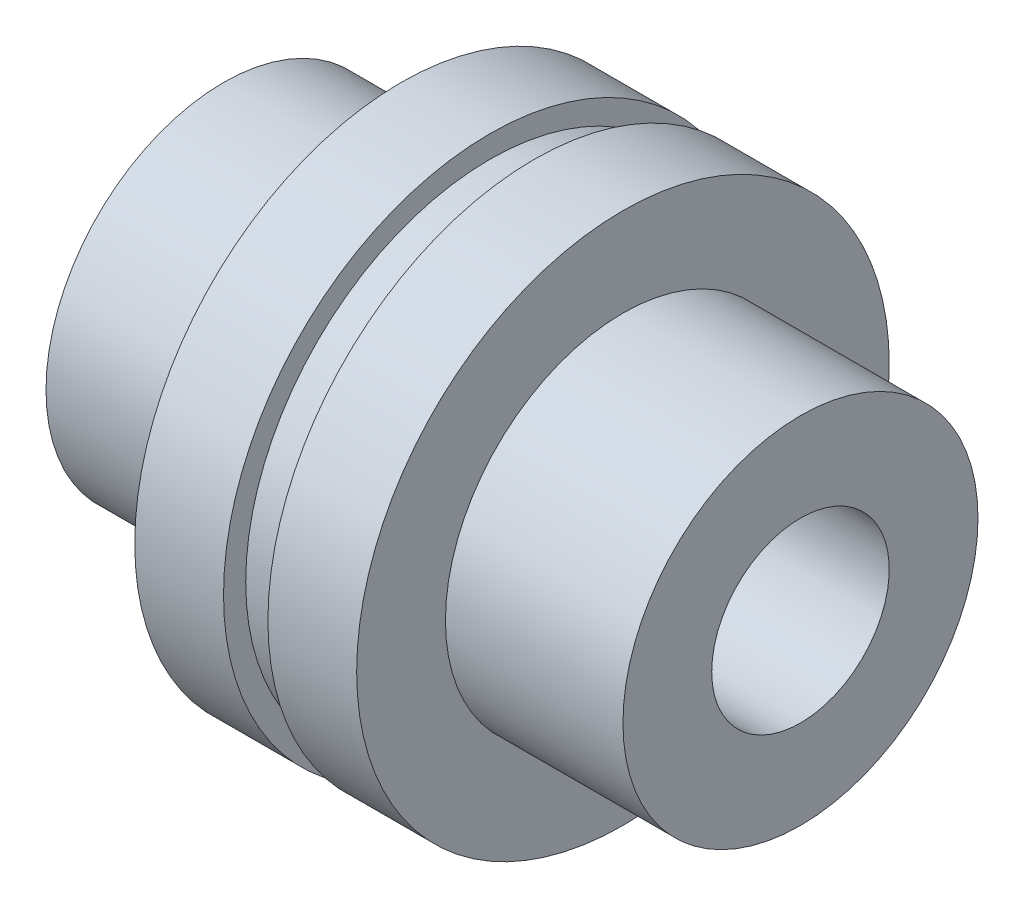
ISO-10303-21;
HEADER;
FILE_DESCRIPTION(('STEP AP214'),'2;1');
FILE_NAME('part.step','',(''),(''),'','','');
FILE_SCHEMA(('AUTOMOTIVE_DESIGN { 1 0 10303 214 1 1 1 1 }'));
ENDSEC;
DATA;
#1=APPLICATION_CONTEXT('core data for automotive mechanical design processes');
#2=APPLICATION_PROTOCOL_DEFINITION('international standard','automotive_design',2000,#1);
#3=PRODUCT_CONTEXT('',#1,'mechanical');
#4=PRODUCT('Part','Part','',(#3));
#5=PRODUCT_RELATED_PRODUCT_CATEGORY('part','',(#4));
#6=PRODUCT_DEFINITION_FORMATION('','',#4);
#7=PRODUCT_DEFINITION_CONTEXT('part definition',#1,'design');
#8=PRODUCT_DEFINITION('design','',#6,#7);
#9=PRODUCT_DEFINITION_SHAPE('','',#8);
#10=(LENGTH_UNIT() NAMED_UNIT(*) SI_UNIT(.MILLI.,.METRE.));
#11=(NAMED_UNIT(*) PLANE_ANGLE_UNIT() SI_UNIT($,.RADIAN.));
#12=(NAMED_UNIT(*) SI_UNIT($,.STERADIAN.) SOLID_ANGLE_UNIT());
#13=UNCERTAINTY_MEASURE_WITH_UNIT(LENGTH_MEASURE(1.E-05),#10,'distance_accuracy_value','');
#14=(GEOMETRIC_REPRESENTATION_CONTEXT(3) GLOBAL_UNCERTAINTY_ASSIGNED_CONTEXT((#13)) GLOBAL_UNIT_ASSIGNED_CONTEXT((#10,
#11,#12)) REPRESENTATION_CONTEXT('',''));
#15=CARTESIAN_POINT('',(0.,0.,0.));
#16=DIRECTION('',(0.,0.,1.));
#17=DIRECTION('',(1.,0.,0.));
#18=AXIS2_PLACEMENT_3D('',#15,#16,#17);
#19=CARTESIAN_POINT('',(0.,0.,0.));
#20=DIRECTION('',(-1.,0.,0.));
#21=DIRECTION('',(0.,0.,1.));
#22=AXIS2_PLACEMENT_3D('',#19,#20,#21);
#23=CYLINDRICAL_SURFACE('',#22,25.4);
#24=CARTESIAN_POINT('',(25.4,0.,0.));
#25=DIRECTION('',(-1.,0.,0.));
#26=DIRECTION('',(0.,0.,1.));
#27=AXIS2_PLACEMENT_3D('',#24,#25,#26);
#28=CIRCLE('',#27,25.4);
#29=CARTESIAN_POINT('',(25.4,0.,25.4));
#30=VERTEX_POINT('',#29);
#31=EDGE_CURVE('E68',#30,#30,#28,.T.);
#32=ORIENTED_EDGE('',*,*,#31,.T.);
#33=EDGE_LOOP('',(#32));
#34=FACE_BOUND('',#33,.T.);
#35=CARTESIAN_POINT('',(0.,0.,0.));
#36=DIRECTION('',(-1.,0.,0.));
#37=DIRECTION('',(0.,0.,1.));
#38=AXIS2_PLACEMENT_3D('',#35,#36,#37);
#39=CIRCLE('',#38,25.4);
#40=CARTESIAN_POINT('',(0.,0.,25.4));
#41=VERTEX_POINT('',#40);
#42=EDGE_CURVE('E10',#41,#41,#39,.T.);
#43=ORIENTED_EDGE('',*,*,#42,.F.);
#44=EDGE_LOOP('',(#43));
#45=FACE_BOUND('',#44,.T.);
#46=ADVANCED_FACE('F28',(#34,#45),#23,.T.);
#47=CARTESIAN_POINT('',(0.,12.7,0.));
#48=DIRECTION('',(-1.,0.,0.));
#49=DIRECTION('',(0.,0.,1.));
#50=AXIS2_PLACEMENT_3D('',#47,#48,#49);
#51=PLANE('',#50);
#52=ORIENTED_EDGE('',*,*,#42,.T.);
#53=EDGE_LOOP('',(#52));
#54=FACE_BOUND('',#53,.T.);
#55=CARTESIAN_POINT('',(0.,0.,0.));
#56=DIRECTION('',(-1.,0.,0.));
#57=DIRECTION('',(0.,0.,1.));
#58=AXIS2_PLACEMENT_3D('',#55,#56,#57);
#59=CIRCLE('',#58,12.7);
#60=CARTESIAN_POINT('',(0.,0.,12.7));
#61=VERTEX_POINT('',#60);
#62=EDGE_CURVE('E34',#61,#61,#59,.T.);
#63=ORIENTED_EDGE('',*,*,#62,.F.);
#64=EDGE_LOOP('',(#63));
#65=FACE_BOUND('',#64,.T.);
#66=ADVANCED_FACE('F86',(#54,#65),#51,.T.);
#67=CARTESIAN_POINT('',(0.,0.,0.));
#68=DIRECTION('',(-1.,0.,0.));
#69=DIRECTION('',(0.,0.,1.));
#70=AXIS2_PLACEMENT_3D('',#67,#68,#69);
#71=CYLINDRICAL_SURFACE('',#70,12.7);
#72=CARTESIAN_POINT('',(82.55,0.,0.));
#73=DIRECTION('',(-1.,0.,0.));
#74=DIRECTION('',(0.,0.,1.));
#75=AXIS2_PLACEMENT_3D('',#72,#73,#74);
#76=CIRCLE('',#75,12.7);
#77=CARTESIAN_POINT('',(82.55,0.,12.7));
#78=VERTEX_POINT('',#77);
#79=EDGE_CURVE('E38',#78,#78,#76,.T.);
#80=ORIENTED_EDGE('',*,*,#79,.F.);
#81=EDGE_LOOP('',(#80));
#82=FACE_BOUND('',#81,.T.);
#83=ORIENTED_EDGE('',*,*,#62,.T.);
#84=EDGE_LOOP('',(#83));
#85=FACE_BOUND('',#84,.T.);
#86=ADVANCED_FACE('F90',(#82,#85),#71,.F.);
#87=CARTESIAN_POINT('',(82.55,12.7,0.));
#88=DIRECTION('',(-1.,0.,0.));
#89=DIRECTION('',(0.,0.,1.));
#90=AXIS2_PLACEMENT_3D('',#87,#88,#89);
#91=PLANE('',#90);
#92=CARTESIAN_POINT('',(82.55,0.,0.));
#93=DIRECTION('',(-1.,0.,0.));
#94=DIRECTION('',(0.,0.,1.));
#95=AXIS2_PLACEMENT_3D('',#92,#93,#94);
#96=CIRCLE('',#95,25.4);
#97=CARTESIAN_POINT('',(82.55,0.,25.4));
#98=VERTEX_POINT('',#97);
#99=EDGE_CURVE('E42',#98,#98,#96,.T.);
#100=ORIENTED_EDGE('',*,*,#99,.F.);
#101=EDGE_LOOP('',(#100));
#102=FACE_BOUND('',#101,.T.);
#103=ORIENTED_EDGE('',*,*,#79,.T.);
#104=EDGE_LOOP('',(#103));
#105=FACE_BOUND('',#104,.T.);
#106=ADVANCED_FACE('F94',(#102,#105),#91,.F.);
#107=CARTESIAN_POINT('',(0.,0.,0.));
#108=DIRECTION('',(-1.,0.,0.));
#109=DIRECTION('',(0.,0.,1.));
#110=AXIS2_PLACEMENT_3D('',#107,#108,#109);
#111=CYLINDRICAL_SURFACE('',#110,25.4);
#112=CARTESIAN_POINT('',(57.15,0.,0.));
#113=DIRECTION('',(-1.,0.,0.));
#114=DIRECTION('',(0.,0.,1.));
#115=AXIS2_PLACEMENT_3D('',#112,#113,#114);
#116=CIRCLE('',#115,25.4);
#117=CARTESIAN_POINT('',(57.15,0.,25.4));
#118=VERTEX_POINT('',#117);
#119=EDGE_CURVE('E47',#118,#118,#116,.T.);
#120=ORIENTED_EDGE('',*,*,#119,.F.);
#121=EDGE_LOOP('',(#120));
#122=FACE_BOUND('',#121,.T.);
#123=ORIENTED_EDGE('',*,*,#99,.T.);
#124=EDGE_LOOP('',(#123));
#125=FACE_BOUND('',#124,.T.);
#126=ADVANCED_FACE('F101',(#122,#125),#111,.T.);
#127=CARTESIAN_POINT('',(57.15,25.4,0.));
#128=DIRECTION('',(-1.,0.,0.));
#129=DIRECTION('',(0.,0.,1.));
#130=AXIS2_PLACEMENT_3D('',#127,#128,#129);
#131=PLANE('',#130);
#132=CARTESIAN_POINT('',(57.15,0.,0.));
#133=DIRECTION('',(-1.,0.,0.));
#134=DIRECTION('',(0.,0.,1.));
#135=AXIS2_PLACEMENT_3D('',#132,#133,#134);
#136=CIRCLE('',#135,38.1);
#137=CARTESIAN_POINT('',(57.15,0.,38.1));
#138=VERTEX_POINT('',#137);
#139=EDGE_CURVE('E50',#138,#138,#136,.T.);
#140=ORIENTED_EDGE('',*,*,#139,.F.);
#141=EDGE_LOOP('',(#140));
#142=FACE_BOUND('',#141,.T.);
#143=ORIENTED_EDGE('',*,*,#119,.T.);
#144=EDGE_LOOP('',(#143));
#145=FACE_BOUND('',#144,.T.);
#146=ADVANCED_FACE('F105',(#142,#145),#131,.F.);
#147=CARTESIAN_POINT('',(0.,0.,0.));
#148=DIRECTION('',(-1.,0.,0.));
#149=DIRECTION('',(0.,0.,1.));
#150=AXIS2_PLACEMENT_3D('',#147,#148,#149);
#151=CYLINDRICAL_SURFACE('',#150,38.1);
#152=CARTESIAN_POINT('',(44.45,0.,0.));
#153=DIRECTION('',(-1.,0.,0.));
#154=DIRECTION('',(0.,0.,1.));
#155=AXIS2_PLACEMENT_3D('',#152,#153,#154);
#156=CIRCLE('',#155,38.1);
#157=CARTESIAN_POINT('',(44.45,0.,38.1));
#158=VERTEX_POINT('',#157);
#159=EDGE_CURVE('E53',#158,#158,#156,.T.);
#160=ORIENTED_EDGE('',*,*,#159,.F.);
#161=EDGE_LOOP('',(#160));
#162=FACE_BOUND('',#161,.T.);
#163=ORIENTED_EDGE('',*,*,#139,.T.);
#164=EDGE_LOOP('',(#163));
#165=FACE_BOUND('',#164,.T.);
#166=ADVANCED_FACE('F109',(#162,#165),#151,.T.);
#167=CARTESIAN_POINT('',(44.45,38.1,0.));
#168=DIRECTION('',(1.,0.,0.));
#169=DIRECTION('',(0.,0.,-1.));
#170=AXIS2_PLACEMENT_3D('',#167,#168,#169);
#171=PLANE('',#170);
#172=CARTESIAN_POINT('',(44.45,0.,0.));
#173=DIRECTION('',(-1.,0.,0.));
#174=DIRECTION('',(0.,0.,1.));
#175=AXIS2_PLACEMENT_3D('',#172,#173,#174);
#176=CIRCLE('',#175,34.925);
#177=CARTESIAN_POINT('',(44.45,0.,34.925));
#178=VERTEX_POINT('',#177);
#179=EDGE_CURVE('E56',#178,#178,#176,.T.);
#180=ORIENTED_EDGE('',*,*,#179,.F.);
#181=EDGE_LOOP('',(#180));
#182=FACE_BOUND('',#181,.T.);
#183=ORIENTED_EDGE('',*,*,#159,.T.);
#184=EDGE_LOOP('',(#183));
#185=FACE_BOUND('',#184,.T.);
#186=ADVANCED_FACE('F113',(#182,#185),#171,.F.);
#187=CARTESIAN_POINT('',(0.,0.,0.));
#188=DIRECTION('',(-1.,0.,0.));
#189=DIRECTION('',(0.,0.,1.));
#190=AXIS2_PLACEMENT_3D('',#187,#188,#189);
#191=CYLINDRICAL_SURFACE('',#190,34.925);
#192=ORIENTED_EDGE('',*,*,#179,.T.);
#193=EDGE_LOOP('',(#192));
#194=FACE_BOUND('',#193,.T.);
#195=CARTESIAN_POINT('',(38.1,0.,0.));
#196=DIRECTION('',(-1.,0.,0.));
#197=DIRECTION('',(0.,0.,1.));
#198=AXIS2_PLACEMENT_3D('',#195,#196,#197);
#199=CIRCLE('',#198,34.925);
#200=CARTESIAN_POINT('',(38.1,0.,34.925));
#201=VERTEX_POINT('',#200);
#202=EDGE_CURVE('E59',#201,#201,#199,.T.);
#203=ORIENTED_EDGE('',*,*,#202,.F.);
#204=EDGE_LOOP('',(#203));
#205=FACE_BOUND('',#204,.T.);
#206=ADVANCED_FACE('F117',(#194,#205),#191,.T.);
#207=CARTESIAN_POINT('',(38.1,38.1,0.));
#208=DIRECTION('',(1.,0.,0.));
#209=DIRECTION('',(0.,0.,-1.));
#210=AXIS2_PLACEMENT_3D('',#207,#208,#209);
#211=PLANE('',#210);
#212=ORIENTED_EDGE('',*,*,#202,.T.);
#213=EDGE_LOOP('',(#212));
#214=FACE_BOUND('',#213,.T.);
#215=CARTESIAN_POINT('',(38.1,0.,0.));
#216=DIRECTION('',(-1.,0.,0.));
#217=DIRECTION('',(0.,0.,1.));
#218=AXIS2_PLACEMENT_3D('',#215,#216,#217);
#219=CIRCLE('',#218,38.1);
#220=CARTESIAN_POINT('',(38.1,0.,38.1));
#221=VERTEX_POINT('',#220);
#222=EDGE_CURVE('E62',#221,#221,#219,.T.);
#223=ORIENTED_EDGE('',*,*,#222,.F.);
#224=EDGE_LOOP('',(#223));
#225=FACE_BOUND('',#224,.T.);
#226=ADVANCED_FACE('F82',(#214,#225),#211,.T.);
#227=CARTESIAN_POINT('',(0.,0.,0.));
#228=DIRECTION('',(-1.,0.,0.));
#229=DIRECTION('',(0.,0.,1.));
#230=AXIS2_PLACEMENT_3D('',#227,#228,#229);
#231=CYLINDRICAL_SURFACE('',#230,38.1);
#232=ORIENTED_EDGE('',*,*,#222,.T.);
#233=EDGE_LOOP('',(#232));
#234=FACE_BOUND('',#233,.T.);
#235=CARTESIAN_POINT('',(25.4,0.,0.));
#236=DIRECTION('',(-1.,0.,0.));
#237=DIRECTION('',(0.,0.,1.));
#238=AXIS2_PLACEMENT_3D('',#235,#236,#237);
#239=CIRCLE('',#238,38.1);
#240=CARTESIAN_POINT('',(25.4,0.,38.1));
#241=VERTEX_POINT('',#240);
#242=EDGE_CURVE('E65',#241,#241,#239,.T.);
#243=ORIENTED_EDGE('',*,*,#242,.F.);
#244=EDGE_LOOP('',(#243));
#245=FACE_BOUND('',#244,.T.);
#246=ADVANCED_FACE('F76',(#234,#245),#231,.T.);
#247=CARTESIAN_POINT('',(25.4,25.4,0.));
#248=DIRECTION('',(-1.,0.,0.));
#249=DIRECTION('',(0.,0.,1.));
#250=AXIS2_PLACEMENT_3D('',#247,#248,#249);
#251=PLANE('',#250);
#252=ORIENTED_EDGE('',*,*,#242,.T.);
#253=EDGE_LOOP('',(#252));
#254=FACE_BOUND('',#253,.T.);
#255=ORIENTED_EDGE('',*,*,#31,.F.);
#256=EDGE_LOOP('',(#255));
#257=FACE_BOUND('',#256,.T.);
#258=ADVANCED_FACE('F74',(#254,#257),#251,.T.);
#259=CLOSED_SHELL('',(#46,#66,#86,#106,#126,#146,#166,#186,#206,#226,#246,#258));
#260=MANIFOLD_SOLID_BREP('B2',#259);
#261=ADVANCED_BREP_SHAPE_REPRESENTATION('',(#18,#260),#14);
#262=SHAPE_DEFINITION_REPRESENTATION(#9,#261);
ENDSEC;
END-ISO-10303-21;
